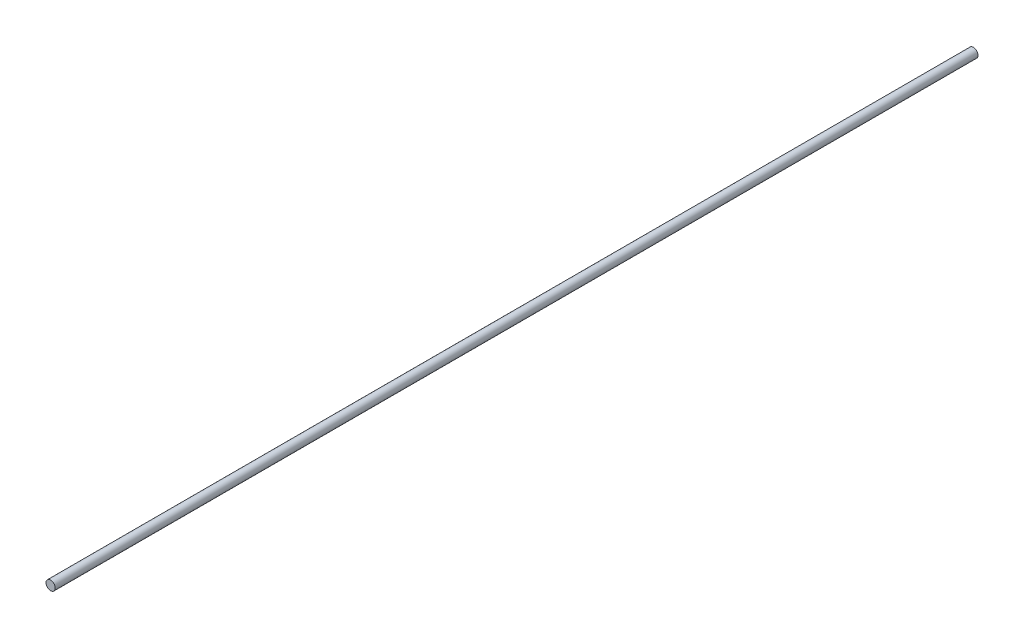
ISO-10303-21;
HEADER;
FILE_DESCRIPTION(('STEP AP214'),'2;1');
FILE_NAME('part.step','',(''),(''),'','','');
FILE_SCHEMA(('AUTOMOTIVE_DESIGN { 1 0 10303 214 1 1 1 1 }'));
ENDSEC;
DATA;
#1=APPLICATION_CONTEXT('core data for automotive mechanical design processes');
#2=APPLICATION_PROTOCOL_DEFINITION('international standard','automotive_design',2000,#1);
#3=PRODUCT_CONTEXT('',#1,'mechanical');
#4=PRODUCT('Part','Part','',(#3));
#5=PRODUCT_RELATED_PRODUCT_CATEGORY('part','',(#4));
#6=PRODUCT_DEFINITION_FORMATION('','',#4);
#7=PRODUCT_DEFINITION_CONTEXT('part definition',#1,'design');
#8=PRODUCT_DEFINITION('design','',#6,#7);
#9=PRODUCT_DEFINITION_SHAPE('','',#8);
#10=(LENGTH_UNIT() NAMED_UNIT(*) SI_UNIT(.MILLI.,.METRE.));
#11=(NAMED_UNIT(*) PLANE_ANGLE_UNIT() SI_UNIT($,.RADIAN.));
#12=(NAMED_UNIT(*) SI_UNIT($,.STERADIAN.) SOLID_ANGLE_UNIT());
#13=UNCERTAINTY_MEASURE_WITH_UNIT(LENGTH_MEASURE(1.E-05),#10,'distance_accuracy_value','');
#14=(GEOMETRIC_REPRESENTATION_CONTEXT(3) GLOBAL_UNCERTAINTY_ASSIGNED_CONTEXT((#13)) GLOBAL_UNIT_ASSIGNED_CONTEXT((#10,
#11,#12)) REPRESENTATION_CONTEXT('',''));
#15=CARTESIAN_POINT('',(0.,0.,0.));
#16=DIRECTION('',(0.,0.,1.));
#17=DIRECTION('',(1.,0.,0.));
#18=AXIS2_PLACEMENT_3D('',#15,#16,#17);
#19=CARTESIAN_POINT('',(0.,0.,990.));
#20=DIRECTION('',(0.,0.,-1.));
#21=DIRECTION('',(-1.,0.,0.));
#22=AXIS2_PLACEMENT_3D('',#19,#20,#21);
#23=CYLINDRICAL_SURFACE('',#22,5.);
#24=CARTESIAN_POINT('',(0.,0.,0.));
#25=DIRECTION('',(0.,0.,1.));
#26=DIRECTION('',(1.,0.,0.));
#27=AXIS2_PLACEMENT_3D('',#24,#25,#26);
#28=CIRCLE('',#27,5.);
#29=CARTESIAN_POINT('',(5.,0.,0.));
#30=VERTEX_POINT('',#29);
#31=EDGE_CURVE('E8',#30,#30,#28,.T.);
#32=ORIENTED_EDGE('',*,*,#31,.T.);
#33=EDGE_LOOP('',(#32));
#34=FACE_BOUND('',#33,.T.);
#35=CARTESIAN_POINT('',(0.,0.,1000.));
#36=DIRECTION('',(0.,0.,-1.));
#37=DIRECTION('',(-1.,0.,0.));
#38=AXIS2_PLACEMENT_3D('',#35,#36,#37);
#39=CIRCLE('',#38,5.);
#40=CARTESIAN_POINT('',(-5.,0.,1000.));
#41=VERTEX_POINT('',#40);
#42=EDGE_CURVE('E18',#41,#41,#39,.T.);
#43=ORIENTED_EDGE('',*,*,#42,.T.);
#44=EDGE_LOOP('',(#43));
#45=FACE_BOUND('',#44,.T.);
#46=ADVANCED_FACE('F12',(#34,#45),#23,.T.);
#47=CARTESIAN_POINT('',(0.,0.,0.));
#48=DIRECTION('',(0.,0.,1.));
#49=DIRECTION('',(1.,0.,0.));
#50=AXIS2_PLACEMENT_3D('',#47,#48,#49);
#51=PLANE('',#50);
#52=ORIENTED_EDGE('',*,*,#31,.F.);
#53=EDGE_LOOP('',(#52));
#54=FACE_BOUND('',#53,.T.);
#55=ADVANCED_FACE('F27',(#54),#51,.F.);
#56=CARTESIAN_POINT('',(0.,0.,1000.));
#57=DIRECTION('',(0.,0.,-1.));
#58=DIRECTION('',(-1.,0.,0.));
#59=AXIS2_PLACEMENT_3D('',#56,#57,#58);
#60=PLANE('',#59);
#61=ORIENTED_EDGE('',*,*,#42,.F.);
#62=EDGE_LOOP('',(#61));
#63=FACE_BOUND('',#62,.T.);
#64=ADVANCED_FACE('F25',(#63),#60,.F.);
#65=CLOSED_SHELL('',(#46,#55,#64));
#66=MANIFOLD_SOLID_BREP('B1',#65);
#67=ADVANCED_BREP_SHAPE_REPRESENTATION('',(#18,#66),#14);
#68=SHAPE_DEFINITION_REPRESENTATION(#9,#67);
ENDSEC;
END-ISO-10303-21;
